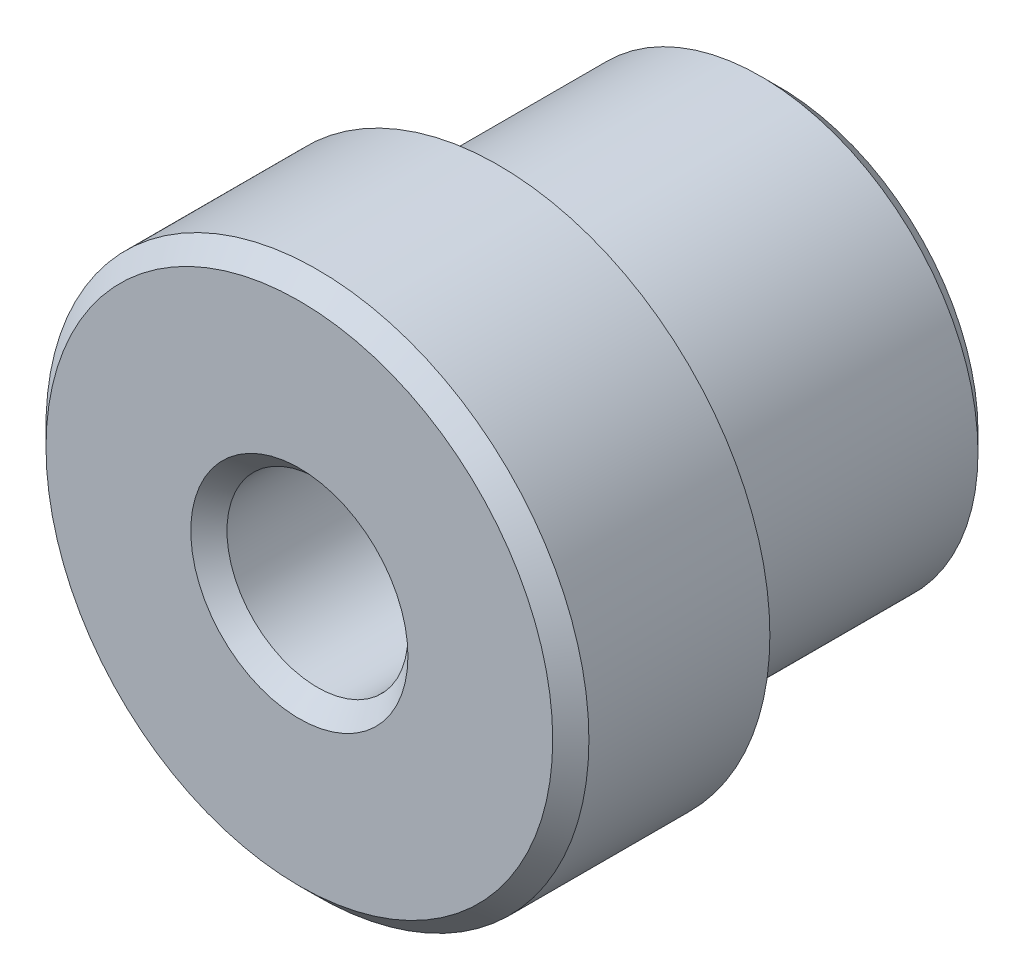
ISO-10303-21;
HEADER;
FILE_DESCRIPTION(('STEP AP214'),'2;1');
FILE_NAME('part.step','',(''),(''),'','','');
FILE_SCHEMA(('AUTOMOTIVE_DESIGN { 1 0 10303 214 1 1 1 1 }'));
ENDSEC;
DATA;
#1=APPLICATION_CONTEXT('core data for automotive mechanical design processes');
#2=APPLICATION_PROTOCOL_DEFINITION('international standard','automotive_design',2000,#1);
#3=PRODUCT_CONTEXT('',#1,'mechanical');
#4=PRODUCT('Part','Part','',(#3));
#5=PRODUCT_RELATED_PRODUCT_CATEGORY('part','',(#4));
#6=PRODUCT_DEFINITION_FORMATION('','',#4);
#7=PRODUCT_DEFINITION_CONTEXT('part definition',#1,'design');
#8=PRODUCT_DEFINITION('design','',#6,#7);
#9=PRODUCT_DEFINITION_SHAPE('','',#8);
#10=(LENGTH_UNIT() NAMED_UNIT(*) SI_UNIT(.MILLI.,.METRE.));
#11=(NAMED_UNIT(*) PLANE_ANGLE_UNIT() SI_UNIT($,.RADIAN.));
#12=(NAMED_UNIT(*) SI_UNIT($,.STERADIAN.) SOLID_ANGLE_UNIT());
#13=UNCERTAINTY_MEASURE_WITH_UNIT(LENGTH_MEASURE(1.E-05),#10,'distance_accuracy_value','');
#14=(GEOMETRIC_REPRESENTATION_CONTEXT(3) GLOBAL_UNCERTAINTY_ASSIGNED_CONTEXT((#13)) GLOBAL_UNIT_ASSIGNED_CONTEXT((#10,
#11,#12)) REPRESENTATION_CONTEXT('',''));
#15=CARTESIAN_POINT('',(0.,0.,0.));
#16=DIRECTION('',(0.,0.,1.));
#17=DIRECTION('',(1.,0.,0.));
#18=AXIS2_PLACEMENT_3D('',#15,#16,#17);
#19=CARTESIAN_POINT('',(0.,0.,0.));
#20=DIRECTION('',(0.,0.,1.));
#21=DIRECTION('',(1.,0.,0.));
#22=AXIS2_PLACEMENT_3D('',#19,#20,#21);
#23=PLANE('',#22);
#24=CARTESIAN_POINT('',(0.,0.,0.));
#25=DIRECTION('',(0.,0.,1.));
#26=DIRECTION('',(1.,0.,0.));
#27=AXIS2_PLACEMENT_3D('',#24,#25,#26);
#28=CIRCLE('',#27,6.);
#29=CARTESIAN_POINT('',(6.,0.,0.));
#30=VERTEX_POINT('',#29);
#31=EDGE_CURVE('E37',#30,#30,#28,.T.);
#32=ORIENTED_EDGE('',*,*,#31,.T.);
#33=EDGE_LOOP('',(#32));
#34=FACE_BOUND('',#33,.T.);
#35=CARTESIAN_POINT('',(0.,0.,0.));
#36=DIRECTION('',(0.,0.,1.));
#37=DIRECTION('',(1.,0.,0.));
#38=AXIS2_PLACEMENT_3D('',#35,#36,#37);
#39=CIRCLE('',#38,11.);
#40=CARTESIAN_POINT('',(11.,0.,0.));
#41=VERTEX_POINT('',#40);
#42=EDGE_CURVE('E41',#41,#41,#39,.F.);
#43=ORIENTED_EDGE('',*,*,#42,.T.);
#44=EDGE_LOOP('',(#43));
#45=FACE_BOUND('',#44,.T.);
#46=ADVANCED_FACE('F30',(#34,#45),#23,.F.);
#47=CARTESIAN_POINT('',(0.,0.,15.5));
#48=DIRECTION('',(0.,0.,-1.));
#49=DIRECTION('',(-1.,0.,0.));
#50=AXIS2_PLACEMENT_3D('',#47,#48,#49);
#51=CYLINDRICAL_SURFACE('',#50,12.);
#52=CARTESIAN_POINT('',(0.,0.,1.));
#53=DIRECTION('',(0.,0.,1.));
#54=DIRECTION('',(1.,0.,0.));
#55=AXIS2_PLACEMENT_3D('',#52,#53,#54);
#56=CIRCLE('',#55,12.);
#57=CARTESIAN_POINT('',(12.,0.,1.));
#58=VERTEX_POINT('',#57);
#59=EDGE_CURVE('E10',#58,#58,#56,.T.);
#60=ORIENTED_EDGE('',*,*,#59,.T.);
#61=EDGE_LOOP('',(#60));
#62=FACE_BOUND('',#61,.T.);
#63=CARTESIAN_POINT('',(0.,0.,15.5));
#64=DIRECTION('',(0.,0.,1.));
#65=DIRECTION('',(1.,0.,0.));
#66=AXIS2_PLACEMENT_3D('',#63,#64,#65);
#67=CIRCLE('',#66,12.);
#68=CARTESIAN_POINT('',(12.,0.,15.5));
#69=VERTEX_POINT('',#68);
#70=EDGE_CURVE('E62',#69,#69,#67,.T.);
#71=ORIENTED_EDGE('',*,*,#70,.F.);
#72=EDGE_LOOP('',(#71));
#73=FACE_BOUND('',#72,.T.);
#74=ADVANCED_FACE('F79',(#62,#73),#51,.T.);
#75=CARTESIAN_POINT('',(0.,0.,15.5));
#76=DIRECTION('',(0.,0.,-1.));
#77=DIRECTION('',(-1.,0.,0.));
#78=AXIS2_PLACEMENT_3D('',#75,#76,#77);
#79=CYLINDRICAL_SURFACE('',#78,5.);
#80=CARTESIAN_POINT('',(0.,0.,25.5));
#81=DIRECTION('',(0.,0.,1.));
#82=DIRECTION('',(1.,0.,0.));
#83=AXIS2_PLACEMENT_3D('',#80,#81,#82);
#84=CIRCLE('',#83,5.);
#85=CARTESIAN_POINT('',(5.,0.,25.5));
#86=VERTEX_POINT('',#85);
#87=EDGE_CURVE('E56',#86,#86,#84,.T.);
#88=ORIENTED_EDGE('',*,*,#87,.T.);
#89=EDGE_LOOP('',(#88));
#90=FACE_BOUND('',#89,.T.);
#91=CARTESIAN_POINT('',(0.,0.,1.));
#92=DIRECTION('',(0.,0.,1.));
#93=DIRECTION('',(1.,0.,0.));
#94=AXIS2_PLACEMENT_3D('',#91,#92,#93);
#95=CIRCLE('',#94,5.);
#96=CARTESIAN_POINT('',(5.,0.,1.));
#97=VERTEX_POINT('',#96);
#98=EDGE_CURVE('E59',#97,#97,#95,.F.);
#99=ORIENTED_EDGE('',*,*,#98,.T.);
#100=EDGE_LOOP('',(#99));
#101=FACE_BOUND('',#100,.T.);
#102=ADVANCED_FACE('F75',(#90,#101),#79,.F.);
#103=CARTESIAN_POINT('',(0.,0.,15.5));
#104=DIRECTION('',(0.,0.,1.));
#105=DIRECTION('',(1.,0.,0.));
#106=AXIS2_PLACEMENT_3D('',#103,#104,#105);
#107=PLANE('',#106);
#108=CARTESIAN_POINT('',(0.,0.,15.5));
#109=DIRECTION('',(0.,0.,1.));
#110=DIRECTION('',(1.,0.,0.));
#111=AXIS2_PLACEMENT_3D('',#108,#109,#110);
#112=CIRCLE('',#111,15.);
#113=CARTESIAN_POINT('',(15.,0.,15.5));
#114=VERTEX_POINT('',#113);
#115=EDGE_CURVE('E65',#114,#114,#112,.T.);
#116=ORIENTED_EDGE('',*,*,#115,.F.);
#117=EDGE_LOOP('',(#116));
#118=FACE_BOUND('',#117,.T.);
#119=ORIENTED_EDGE('',*,*,#70,.T.);
#120=EDGE_LOOP('',(#119));
#121=FACE_BOUND('',#120,.T.);
#122=ADVANCED_FACE('F71',(#118,#121),#107,.F.);
#123=CARTESIAN_POINT('',(0.,0.,26.5));
#124=DIRECTION('',(0.,0.,1.));
#125=DIRECTION('',(1.,0.,0.));
#126=AXIS2_PLACEMENT_3D('',#123,#124,#125);
#127=PLANE('',#126);
#128=CARTESIAN_POINT('',(0.,0.,26.5));
#129=DIRECTION('',(0.,0.,1.));
#130=DIRECTION('',(1.,0.,0.));
#131=AXIS2_PLACEMENT_3D('',#128,#129,#130);
#132=CIRCLE('',#131,6.00000000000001);
#133=CARTESIAN_POINT('',(6.00000000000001,0.,26.5));
#134=VERTEX_POINT('',#133);
#135=EDGE_CURVE('E50',#134,#134,#132,.F.);
#136=ORIENTED_EDGE('',*,*,#135,.T.);
#137=EDGE_LOOP('',(#136));
#138=FACE_BOUND('',#137,.T.);
#139=CARTESIAN_POINT('',(0.,0.,26.5));
#140=DIRECTION('',(0.,0.,1.));
#141=DIRECTION('',(1.,0.,0.));
#142=AXIS2_PLACEMENT_3D('',#139,#140,#141);
#143=CIRCLE('',#142,14.);
#144=CARTESIAN_POINT('',(14.,0.,26.5));
#145=VERTEX_POINT('',#144);
#146=EDGE_CURVE('E53',#145,#145,#143,.T.);
#147=ORIENTED_EDGE('',*,*,#146,.T.);
#148=EDGE_LOOP('',(#147));
#149=FACE_BOUND('',#148,.T.);
#150=ADVANCED_FACE('F74',(#138,#149),#127,.T.);
#151=CARTESIAN_POINT('',(0.,0.,26.5));
#152=DIRECTION('',(0.,0.,-1.));
#153=DIRECTION('',(-1.,0.,0.));
#154=AXIS2_PLACEMENT_3D('',#151,#152,#153);
#155=CYLINDRICAL_SURFACE('',#154,15.);
#156=CARTESIAN_POINT('',(0.,0.,25.5));
#157=DIRECTION('',(0.,0.,1.));
#158=DIRECTION('',(1.,0.,0.));
#159=AXIS2_PLACEMENT_3D('',#156,#157,#158);
#160=CIRCLE('',#159,15.);
#161=CARTESIAN_POINT('',(15.,0.,25.5));
#162=VERTEX_POINT('',#161);
#163=EDGE_CURVE('E45',#162,#162,#160,.F.);
#164=ORIENTED_EDGE('',*,*,#163,.T.);
#165=EDGE_LOOP('',(#164));
#166=FACE_BOUND('',#165,.T.);
#167=ORIENTED_EDGE('',*,*,#115,.T.);
#168=EDGE_LOOP('',(#167));
#169=FACE_BOUND('',#168,.T.);
#170=ADVANCED_FACE('F69',(#166,#169),#155,.T.);
#171=CARTESIAN_POINT('',(0.,0.,25.5));
#172=DIRECTION('',(0.,0.,1.));
#173=DIRECTION('',(1.,0.,0.));
#174=AXIS2_PLACEMENT_3D('',#171,#172,#173);
#175=CONICAL_SURFACE('',#174,5.,0.78539816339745);
#176=ORIENTED_EDGE('',*,*,#135,.F.);
#177=EDGE_LOOP('',(#176));
#178=FACE_BOUND('',#177,.T.);
#179=ORIENTED_EDGE('',*,*,#87,.F.);
#180=EDGE_LOOP('',(#179));
#181=FACE_BOUND('',#180,.T.);
#182=ADVANCED_FACE('F90',(#178,#181),#175,.F.);
#183=CARTESIAN_POINT('',(0.,0.,26.5));
#184=DIRECTION('',(0.,0.,-1.));
#185=DIRECTION('',(-1.,0.,0.));
#186=AXIS2_PLACEMENT_3D('',#183,#184,#185);
#187=CONICAL_SURFACE('',#186,14.,0.785398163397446);
#188=ORIENTED_EDGE('',*,*,#163,.F.);
#189=EDGE_LOOP('',(#188));
#190=FACE_BOUND('',#189,.T.);
#191=ORIENTED_EDGE('',*,*,#146,.F.);
#192=EDGE_LOOP('',(#191));
#193=FACE_BOUND('',#192,.T.);
#194=ADVANCED_FACE('F93',(#190,#193),#187,.T.);
#195=CARTESIAN_POINT('',(0.,0.,0.));
#196=DIRECTION('',(0.,0.,-1.));
#197=DIRECTION('',(-1.,0.,0.));
#198=AXIS2_PLACEMENT_3D('',#195,#196,#197);
#199=CONICAL_SURFACE('',#198,6.,0.785398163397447);
#200=ORIENTED_EDGE('',*,*,#98,.F.);
#201=EDGE_LOOP('',(#200));
#202=FACE_BOUND('',#201,.T.);
#203=ORIENTED_EDGE('',*,*,#31,.F.);
#204=EDGE_LOOP('',(#203));
#205=FACE_BOUND('',#204,.T.);
#206=ADVANCED_FACE('F96',(#202,#205),#199,.F.);
#207=CARTESIAN_POINT('',(0.,0.,1.));
#208=DIRECTION('',(0.,0.,1.));
#209=DIRECTION('',(1.,0.,0.));
#210=AXIS2_PLACEMENT_3D('',#207,#208,#209);
#211=CONICAL_SURFACE('',#210,12.,0.785398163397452);
#212=ORIENTED_EDGE('',*,*,#42,.F.);
#213=EDGE_LOOP('',(#212));
#214=FACE_BOUND('',#213,.T.);
#215=ORIENTED_EDGE('',*,*,#59,.F.);
#216=EDGE_LOOP('',(#215));
#217=FACE_BOUND('',#216,.T.);
#218=ADVANCED_FACE('F32',(#214,#217),#211,.T.);
#219=CLOSED_SHELL('',(#46,#74,#102,#122,#150,#170,#182,#194,#206,#218));
#220=MANIFOLD_SOLID_BREP('B2',#219);
#221=ADVANCED_BREP_SHAPE_REPRESENTATION('',(#18,#220),#14);
#222=SHAPE_DEFINITION_REPRESENTATION(#9,#221);
ENDSEC;
END-ISO-10303-21;
